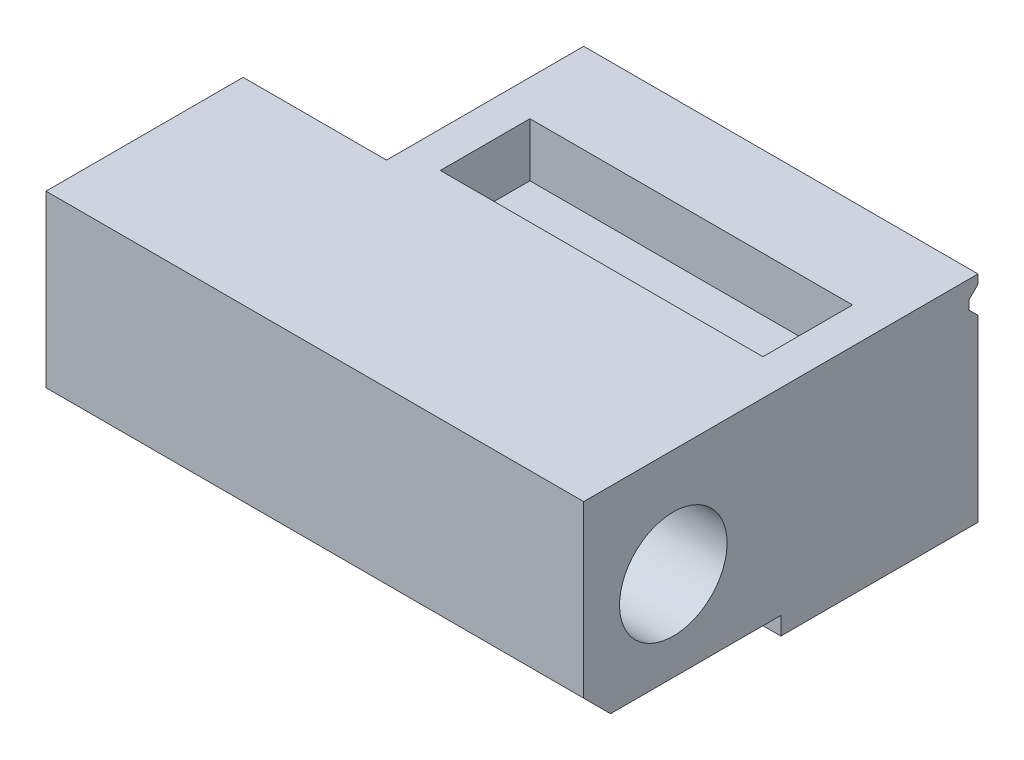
ISO-10303-21;
HEADER;
FILE_DESCRIPTION(('STEP AP214'),'2;1');
FILE_NAME('part.step','',(''),(''),'','','');
FILE_SCHEMA(('AUTOMOTIVE_DESIGN { 1 0 10303 214 1 1 1 1 }'));
ENDSEC;
DATA;
#1=APPLICATION_CONTEXT('core data for automotive mechanical design processes');
#2=APPLICATION_PROTOCOL_DEFINITION('international standard','automotive_design',2000,#1);
#3=PRODUCT_CONTEXT('',#1,'mechanical');
#4=PRODUCT('Part','Part','',(#3));
#5=PRODUCT_RELATED_PRODUCT_CATEGORY('part','',(#4));
#6=PRODUCT_DEFINITION_FORMATION('','',#4);
#7=PRODUCT_DEFINITION_CONTEXT('part definition',#1,'design');
#8=PRODUCT_DEFINITION('design','',#6,#7);
#9=PRODUCT_DEFINITION_SHAPE('','',#8);
#10=(LENGTH_UNIT() NAMED_UNIT(*) SI_UNIT(.MILLI.,.METRE.));
#11=(NAMED_UNIT(*) PLANE_ANGLE_UNIT() SI_UNIT($,.RADIAN.));
#12=(NAMED_UNIT(*) SI_UNIT($,.STERADIAN.) SOLID_ANGLE_UNIT());
#13=UNCERTAINTY_MEASURE_WITH_UNIT(LENGTH_MEASURE(1.E-05),#10,'distance_accuracy_value','');
#14=(GEOMETRIC_REPRESENTATION_CONTEXT(3) GLOBAL_UNCERTAINTY_ASSIGNED_CONTEXT((#13)) GLOBAL_UNIT_ASSIGNED_CONTEXT((#10,
#11,#12)) REPRESENTATION_CONTEXT('',''));
#15=CARTESIAN_POINT('',(0.,0.,0.));
#16=DIRECTION('',(0.,0.,1.));
#17=DIRECTION('',(1.,0.,0.));
#18=AXIS2_PLACEMENT_3D('',#15,#16,#17);
#19=CARTESIAN_POINT('',(-220.,60.,0.));
#20=DIRECTION('',(0.,0.,1.));
#21=DIRECTION('',(1.,0.,0.));
#22=AXIS2_PLACEMENT_3D('',#19,#20,#21);
#23=PLANE('',#22);
#24=DIRECTION('',(1.,0.,0.));
#25=VECTOR('',#24,1.);
#26=CARTESIAN_POINT('',(-220.,-60.,0.));
#27=LINE('',#26,#25);
#28=CARTESIAN_POINT('',(-220.,-60.,0.));
#29=VERTEX_POINT('',#28);
#30=CARTESIAN_POINT('',(0.,-60.,0.));
#31=VERTEX_POINT('',#30);
#32=EDGE_CURVE('E202',#29,#31,#27,.T.);
#33=ORIENTED_EDGE('',*,*,#32,.F.);
#34=DIRECTION('',(0.,-1.,0.));
#35=VECTOR('',#34,1.);
#36=CARTESIAN_POINT('',(-220.,60.,0.));
#37=LINE('',#36,#35);
#38=CARTESIAN_POINT('',(-220.,40.,0.));
#39=VERTEX_POINT('',#38);
#40=EDGE_CURVE('E270',#39,#29,#37,.T.);
#41=ORIENTED_EDGE('',*,*,#40,.F.);
#42=DIRECTION('',(1.,0.,0.));
#43=VECTOR('',#42,1.);
#44=CARTESIAN_POINT('',(-220.,40.,0.));
#45=LINE('',#44,#43);
#46=CARTESIAN_POINT('',(0.,40.,0.));
#47=VERTEX_POINT('',#46);
#48=EDGE_CURVE('E11',#39,#47,#45,.T.);
#49=ORIENTED_EDGE('',*,*,#48,.T.);
#50=DIRECTION('',(0.,1.,0.));
#51=VECTOR('',#50,1.);
#52=CARTESIAN_POINT('',(0.,60.,0.));
#53=LINE('',#52,#51);
#54=EDGE_CURVE('E201',#31,#47,#53,.T.);
#55=ORIENTED_EDGE('',*,*,#54,.F.);
#56=EDGE_LOOP('',(#33,#41,#49,#55));
#57=FACE_BOUND('',#56,.T.);
#58=ADVANCED_FACE('F31',(#57),#23,.F.);
#59=CARTESIAN_POINT('',(-220.,60.,110.));
#60=DIRECTION('',(1.,0.,0.));
#61=DIRECTION('',(0.,1.,0.));
#62=AXIS2_PLACEMENT_3D('',#59,#60,#61);
#63=PLANE('',#62);
#64=DIRECTION('',(0.,-1.,0.));
#65=VECTOR('',#64,1.);
#66=CARTESIAN_POINT('',(-220.,60.,5.));
#67=LINE('',#66,#65);
#68=CARTESIAN_POINT('',(-220.,50.,5.));
#69=VERTEX_POINT('',#68);
#70=CARTESIAN_POINT('',(-220.,45.,5.));
#71=VERTEX_POINT('',#70);
#72=EDGE_CURVE('E290',#69,#71,#67,.T.);
#73=ORIENTED_EDGE('',*,*,#72,.T.);
#74=DIRECTION('',(0.,-0.707106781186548,-0.707106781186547));
#75=VECTOR('',#74,1.);
#76=CARTESIAN_POINT('',(-220.,105.,65.));
#77=LINE('',#76,#75);
#78=EDGE_CURVE('E272',#71,#39,#77,.T.);
#79=ORIENTED_EDGE('',*,*,#78,.T.);
#80=ORIENTED_EDGE('',*,*,#40,.T.);
#81=DIRECTION('',(0.,0.,-1.));
#82=VECTOR('',#81,1.);
#83=CARTESIAN_POINT('',(-220.,-60.,110.));
#84=LINE('',#83,#82);
#85=CARTESIAN_POINT('',(-220.,-60.,110.));
#86=VERTEX_POINT('',#85);
#87=EDGE_CURVE('E250',#86,#29,#84,.T.);
#88=ORIENTED_EDGE('',*,*,#87,.F.);
#89=DIRECTION('',(0.,-1.,0.));
#90=VECTOR('',#89,1.);
#91=CARTESIAN_POINT('',(-220.,60.,110.));
#92=LINE('',#91,#90);
#93=CARTESIAN_POINT('',(-220.,-50.,110.));
#94=VERTEX_POINT('',#93);
#95=EDGE_CURVE('E209',#94,#86,#92,.T.);
#96=ORIENTED_EDGE('',*,*,#95,.F.);
#97=DIRECTION('',(0.,0.,1.));
#98=VECTOR('',#97,1.);
#99=CARTESIAN_POINT('',(-220.,-50.,130.));
#100=LINE('',#99,#98);
#101=CARTESIAN_POINT('',(-220.,-50.,130.));
#102=VERTEX_POINT('',#101);
#103=EDGE_CURVE('E262',#94,#102,#100,.T.);
#104=ORIENTED_EDGE('',*,*,#103,.T.);
#105=DIRECTION('',(0.,0.939793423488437,-0.341743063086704));
#106=VECTOR('',#105,1.);
#107=CARTESIAN_POINT('',(-220.,5.,110.));
#108=LINE('',#107,#106);
#109=CARTESIAN_POINT('',(-220.,5.,110.));
#110=VERTEX_POINT('',#109);
#111=EDGE_CURVE('E361',#102,#110,#108,.T.);
#112=ORIENTED_EDGE('',*,*,#111,.T.);
#113=CARTESIAN_POINT('',(-220.,60.,110.));
#114=VERTEX_POINT('',#113);
#115=EDGE_CURVE('E212',#114,#110,#92,.T.);
#116=ORIENTED_EDGE('',*,*,#115,.F.);
#117=DIRECTION('',(0.,0.,-1.));
#118=VECTOR('',#117,1.);
#119=CARTESIAN_POINT('',(-220.,60.,110.));
#120=LINE('',#119,#118);
#121=CARTESIAN_POINT('',(-220.,60.,0.));
#122=VERTEX_POINT('',#121);
#123=EDGE_CURVE('E236',#114,#122,#120,.T.);
#124=ORIENTED_EDGE('',*,*,#123,.T.);
#125=CARTESIAN_POINT('',(-220.,55.,0.));
#126=VERTEX_POINT('',#125);
#127=EDGE_CURVE('E204',#122,#126,#37,.T.);
#128=ORIENTED_EDGE('',*,*,#127,.T.);
#129=DIRECTION('',(0.,-0.707106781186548,0.707106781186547));
#130=VECTOR('',#129,1.);
#131=CARTESIAN_POINT('',(-220.,2.49999999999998,52.5));
#132=LINE('',#131,#130);
#133=EDGE_CURVE('E46',#126,#69,#132,.T.);
#134=ORIENTED_EDGE('',*,*,#133,.T.);
#135=EDGE_LOOP('',(#73,#79,#80,#88,#96,#104,#112,#116,#124,#128,#134));
#136=FACE_BOUND('',#135,.T.);
#137=ADVANCED_FACE('F33',(#136),#63,.F.);
#138=CARTESIAN_POINT('',(-220.,-60.,110.));
#139=DIRECTION('',(0.,1.,0.));
#140=DIRECTION('',(-1.,0.,0.));
#141=AXIS2_PLACEMENT_3D('',#138,#139,#140);
#142=PLANE('',#141);
#143=DIRECTION('',(1.,0.,0.));
#144=VECTOR('',#143,1.);
#145=CARTESIAN_POINT('',(-200.,-60.,50.));
#146=LINE('',#145,#144);
#147=CARTESIAN_POINT('',(-200.,-60.,50.));
#148=VERTEX_POINT('',#147);
#149=CARTESIAN_POINT('',(-20.,-60.,50.));
#150=VERTEX_POINT('',#149);
#151=EDGE_CURVE('E328',#148,#150,#146,.T.);
#152=ORIENTED_EDGE('',*,*,#151,.F.);
#153=DIRECTION('',(0.,0.,-1.));
#154=VECTOR('',#153,1.);
#155=CARTESIAN_POINT('',(-200.,-60.,100.));
#156=LINE('',#155,#154);
#157=CARTESIAN_POINT('',(-200.,-60.,100.));
#158=VERTEX_POINT('',#157);
#159=EDGE_CURVE('E320',#158,#148,#156,.T.);
#160=ORIENTED_EDGE('',*,*,#159,.F.);
#161=DIRECTION('',(-1.,0.,0.));
#162=VECTOR('',#161,1.);
#163=CARTESIAN_POINT('',(-200.,-60.,100.));
#164=LINE('',#163,#162);
#165=CARTESIAN_POINT('',(-20.,-60.,100.));
#166=VERTEX_POINT('',#165);
#167=EDGE_CURVE('E334',#166,#158,#164,.T.);
#168=ORIENTED_EDGE('',*,*,#167,.F.);
#169=DIRECTION('',(0.,0.,1.));
#170=VECTOR('',#169,1.);
#171=CARTESIAN_POINT('',(-20.,-60.,100.));
#172=LINE('',#171,#170);
#173=EDGE_CURVE('E331',#150,#166,#172,.T.);
#174=ORIENTED_EDGE('',*,*,#173,.F.);
#175=EDGE_LOOP('',(#152,#160,#168,#174));
#176=FACE_BOUND('',#175,.T.);
#177=ORIENTED_EDGE('',*,*,#32,.T.);
#178=DIRECTION('',(0.,0.,-1.));
#179=VECTOR('',#178,1.);
#180=CARTESIAN_POINT('',(0.,-60.,110.));
#181=LINE('',#180,#179);
#182=CARTESIAN_POINT('',(0.,-60.,110.));
#183=VERTEX_POINT('',#182);
#184=EDGE_CURVE('E242',#183,#31,#181,.T.);
#185=ORIENTED_EDGE('',*,*,#184,.F.);
#186=DIRECTION('',(1.,0.,0.));
#187=VECTOR('',#186,1.);
#188=CARTESIAN_POINT('',(-220.,-60.,110.));
#189=LINE('',#188,#187);
#190=EDGE_CURVE('E213',#86,#183,#189,.T.);
#191=ORIENTED_EDGE('',*,*,#190,.F.);
#192=ORIENTED_EDGE('',*,*,#87,.T.);
#193=EDGE_LOOP('',(#177,#185,#191,#192));
#194=FACE_BOUND('',#193,.T.);
#195=ADVANCED_FACE('F274',(#176,#194),#142,.F.);
#196=CARTESIAN_POINT('',(0.,60.,110.));
#197=DIRECTION('',(-1.,0.,0.));
#198=DIRECTION('',(0.,-1.,0.));
#199=AXIS2_PLACEMENT_3D('',#196,#197,#198);
#200=PLANE('',#199);
#201=CARTESIAN_POINT('',(0.,0.,170.));
#202=DIRECTION('',(1.,0.,0.));
#203=DIRECTION('',(0.,1.,0.));
#204=AXIS2_PLACEMENT_3D('',#201,#202,#203);
#205=CIRCLE('',#204,30.);
#206=CARTESIAN_POINT('',(0.,30.,170.));
#207=VERTEX_POINT('',#206);
#208=EDGE_CURVE('E284',#207,#207,#205,.T.);
#209=ORIENTED_EDGE('',*,*,#208,.F.);
#210=EDGE_LOOP('',(#209));
#211=FACE_BOUND('',#210,.T.);
#212=ORIENTED_EDGE('',*,*,#54,.T.);
#213=DIRECTION('',(0.,-0.707106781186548,-0.707106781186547));
#214=VECTOR('',#213,1.);
#215=CARTESIAN_POINT('',(0.,45.,5.));
#216=LINE('',#215,#214);
#217=CARTESIAN_POINT('',(0.,45.,5.));
#218=VERTEX_POINT('',#217);
#219=EDGE_CURVE('E386',#218,#47,#216,.T.);
#220=ORIENTED_EDGE('',*,*,#219,.F.);
#221=DIRECTION('',(0.,-1.,0.));
#222=VECTOR('',#221,1.);
#223=CARTESIAN_POINT('',(0.,50.,5.));
#224=LINE('',#223,#222);
#225=CARTESIAN_POINT('',(0.,50.,5.));
#226=VERTEX_POINT('',#225);
#227=EDGE_CURVE('E196',#226,#218,#224,.T.);
#228=ORIENTED_EDGE('',*,*,#227,.F.);
#229=DIRECTION('',(0.,-0.707106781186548,0.707106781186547));
#230=VECTOR('',#229,1.);
#231=CARTESIAN_POINT('',(0.,55.,0.));
#232=LINE('',#231,#230);
#233=CARTESIAN_POINT('',(0.,55.,0.));
#234=VERTEX_POINT('',#233);
#235=EDGE_CURVE('E182',#234,#226,#232,.T.);
#236=ORIENTED_EDGE('',*,*,#235,.F.);
#237=CARTESIAN_POINT('',(0.,60.,0.));
#238=VERTEX_POINT('',#237);
#239=EDGE_CURVE('E192',#234,#238,#53,.T.);
#240=ORIENTED_EDGE('',*,*,#239,.T.);
#241=DIRECTION('',(0.,0.,-1.));
#242=VECTOR('',#241,1.);
#243=CARTESIAN_POINT('',(0.,60.,110.));
#244=LINE('',#243,#242);
#245=CARTESIAN_POINT('',(0.,60.,220.));
#246=VERTEX_POINT('',#245);
#247=EDGE_CURVE('E238',#246,#238,#244,.T.);
#248=ORIENTED_EDGE('',*,*,#247,.F.);
#249=DIRECTION('',(0.,1.,0.));
#250=VECTOR('',#249,1.);
#251=CARTESIAN_POINT('',(0.,60.,220.));
#252=LINE('',#251,#250);
#253=CARTESIAN_POINT('',(0.,-35.0000000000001,220.));
#254=VERTEX_POINT('',#253);
#255=EDGE_CURVE('E276',#254,#246,#252,.T.);
#256=ORIENTED_EDGE('',*,*,#255,.F.);
#257=DIRECTION('',(0.,-0.707106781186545,-0.70710678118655));
#258=VECTOR('',#257,1.);
#259=CARTESIAN_POINT('',(0.,-35.0000000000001,220.));
#260=LINE('',#259,#258);
#261=CARTESIAN_POINT('',(0.,-50.,205.));
#262=VERTEX_POINT('',#261);
#263=EDGE_CURVE('E224',#254,#262,#260,.T.);
#264=ORIENTED_EDGE('',*,*,#263,.T.);
#265=DIRECTION('',(0.,0.,-1.));
#266=VECTOR('',#265,1.);
#267=CARTESIAN_POINT('',(0.,-50.,220.));
#268=LINE('',#267,#266);
#269=CARTESIAN_POINT('',(0.,-50.,110.));
#270=VERTEX_POINT('',#269);
#271=EDGE_CURVE('E226',#262,#270,#268,.T.);
#272=ORIENTED_EDGE('',*,*,#271,.T.);
#273=DIRECTION('',(0.,1.,0.));
#274=VECTOR('',#273,1.);
#275=CARTESIAN_POINT('',(0.,60.,110.));
#276=LINE('',#275,#274);
#277=EDGE_CURVE('E239',#183,#270,#276,.T.);
#278=ORIENTED_EDGE('',*,*,#277,.F.);
#279=ORIENTED_EDGE('',*,*,#184,.T.);
#280=EDGE_LOOP('',(#212,#220,#228,#236,#240,#248,#256,#264,#272,#278,#279));
#281=FACE_BOUND('',#280,.T.);
#282=ADVANCED_FACE('F190',(#211,#281),#200,.F.);
#283=CARTESIAN_POINT('',(-220.,60.,110.));
#284=DIRECTION('',(0.,-1.,0.));
#285=DIRECTION('',(1.,0.,0.));
#286=AXIS2_PLACEMENT_3D('',#283,#284,#285);
#287=PLANE('',#286);
#288=DIRECTION('',(-1.,0.,0.));
#289=VECTOR('',#288,1.);
#290=CARTESIAN_POINT('',(-20.,60.,50.));
#291=LINE('',#290,#289);
#292=CARTESIAN_POINT('',(-20.,60.,50.));
#293=VERTEX_POINT('',#292);
#294=CARTESIAN_POINT('',(-200.,60.,50.));
#295=VERTEX_POINT('',#294);
#296=EDGE_CURVE('E287',#293,#295,#291,.T.);
#297=ORIENTED_EDGE('',*,*,#296,.F.);
#298=DIRECTION('',(0.,0.,-1.));
#299=VECTOR('',#298,1.);
#300=CARTESIAN_POINT('',(-20.,60.,100.));
#301=LINE('',#300,#299);
#302=CARTESIAN_POINT('',(-20.,60.,100.));
#303=VERTEX_POINT('',#302);
#304=EDGE_CURVE('E283',#303,#293,#301,.T.);
#305=ORIENTED_EDGE('',*,*,#304,.F.);
#306=DIRECTION('',(1.,0.,0.));
#307=VECTOR('',#306,1.);
#308=CARTESIAN_POINT('',(-20.,60.,100.));
#309=LINE('',#308,#307);
#310=CARTESIAN_POINT('',(-200.,60.,100.));
#311=VERTEX_POINT('',#310);
#312=EDGE_CURVE('E302',#311,#303,#309,.T.);
#313=ORIENTED_EDGE('',*,*,#312,.F.);
#314=DIRECTION('',(0.,0.,1.));
#315=VECTOR('',#314,1.);
#316=CARTESIAN_POINT('',(-200.,60.,100.));
#317=LINE('',#316,#315);
#318=EDGE_CURVE('E299',#295,#311,#317,.T.);
#319=ORIENTED_EDGE('',*,*,#318,.F.);
#320=EDGE_LOOP('',(#297,#305,#313,#319));
#321=FACE_BOUND('',#320,.T.);
#322=DIRECTION('',(-1.,0.,0.));
#323=VECTOR('',#322,1.);
#324=CARTESIAN_POINT('',(-220.,60.,0.));
#325=LINE('',#324,#323);
#326=EDGE_CURVE('E200',#238,#122,#325,.T.);
#327=ORIENTED_EDGE('',*,*,#326,.T.);
#328=ORIENTED_EDGE('',*,*,#123,.F.);
#329=DIRECTION('',(-1.,0.,0.));
#330=VECTOR('',#329,1.);
#331=CARTESIAN_POINT('',(-300.,60.,110.));
#332=LINE('',#331,#330);
#333=CARTESIAN_POINT('',(-300.,60.,110.));
#334=VERTEX_POINT('',#333);
#335=EDGE_CURVE('E371',#114,#334,#332,.T.);
#336=ORIENTED_EDGE('',*,*,#335,.T.);
#337=DIRECTION('',(0.,0.,-1.));
#338=VECTOR('',#337,1.);
#339=CARTESIAN_POINT('',(-300.,60.,220.));
#340=LINE('',#339,#338);
#341=CARTESIAN_POINT('',(-300.,60.,220.));
#342=VERTEX_POINT('',#341);
#343=EDGE_CURVE('E230',#342,#334,#340,.T.);
#344=ORIENTED_EDGE('',*,*,#343,.F.);
#345=DIRECTION('',(-1.,0.,0.));
#346=VECTOR('',#345,1.);
#347=CARTESIAN_POINT('',(-300.,60.,220.));
#348=LINE('',#347,#346);
#349=EDGE_CURVE('E489',#246,#342,#348,.T.);
#350=ORIENTED_EDGE('',*,*,#349,.F.);
#351=ORIENTED_EDGE('',*,*,#247,.T.);
#352=EDGE_LOOP('',(#327,#328,#336,#344,#350,#351));
#353=FACE_BOUND('',#352,.T.);
#354=ADVANCED_FACE('F420',(#321,#353),#287,.F.);
#355=CARTESIAN_POINT('',(-220.,60.,110.));
#356=DIRECTION('',(0.,0.,1.));
#357=DIRECTION('',(1.,0.,0.));
#358=AXIS2_PLACEMENT_3D('',#355,#356,#357);
#359=PLANE('',#358);
#360=DIRECTION('',(1.,0.,0.));
#361=VECTOR('',#360,1.);
#362=CARTESIAN_POINT('',(-300.,-50.,110.));
#363=LINE('',#362,#361);
#364=EDGE_CURVE('E225',#94,#270,#363,.T.);
#365=ORIENTED_EDGE('',*,*,#364,.F.);
#366=ORIENTED_EDGE('',*,*,#95,.T.);
#367=ORIENTED_EDGE('',*,*,#190,.T.);
#368=ORIENTED_EDGE('',*,*,#277,.T.);
#369=EDGE_LOOP('',(#365,#366,#367,#368));
#370=FACE_BOUND('',#369,.T.);
#371=ADVANCED_FACE('F264',(#370),#359,.T.);
#372=ORIENTED_EDGE('',*,*,#239,.F.);
#373=DIRECTION('',(-1.,0.,0.));
#374=VECTOR('',#373,1.);
#375=CARTESIAN_POINT('',(-220.,55.,0.));
#376=LINE('',#375,#374);
#377=EDGE_CURVE('E39',#234,#126,#376,.T.);
#378=ORIENTED_EDGE('',*,*,#377,.T.);
#379=ORIENTED_EDGE('',*,*,#127,.F.);
#380=ORIENTED_EDGE('',*,*,#326,.F.);
#381=EDGE_LOOP('',(#372,#378,#379,#380));
#382=FACE_BOUND('',#381,.T.);
#383=ADVANCED_FACE('F199',(#382),#23,.F.);
#384=CARTESIAN_POINT('',(-300.,-50.,110.));
#385=DIRECTION('',(0.,0.,1.));
#386=DIRECTION('',(1.,0.,0.));
#387=AXIS2_PLACEMENT_3D('',#384,#385,#386);
#388=PLANE('',#387);
#389=ORIENTED_EDGE('',*,*,#115,.T.);
#390=DIRECTION('',(-1.,0.,0.));
#391=VECTOR('',#390,1.);
#392=CARTESIAN_POINT('',(-220.,5.,110.));
#393=LINE('',#392,#391);
#394=CARTESIAN_POINT('',(-300.,5.,110.));
#395=VERTEX_POINT('',#394);
#396=EDGE_CURVE('E364',#110,#395,#393,.T.);
#397=ORIENTED_EDGE('',*,*,#396,.T.);
#398=DIRECTION('',(0.,-1.,0.));
#399=VECTOR('',#398,1.);
#400=CARTESIAN_POINT('',(-300.,60.,110.));
#401=LINE('',#400,#399);
#402=EDGE_CURVE('E367',#334,#395,#401,.T.);
#403=ORIENTED_EDGE('',*,*,#402,.F.);
#404=ORIENTED_EDGE('',*,*,#335,.F.);
#405=EDGE_LOOP('',(#389,#397,#403,#404));
#406=FACE_BOUND('',#405,.T.);
#407=ADVANCED_FACE('F412',(#406),#388,.F.);
#408=CARTESIAN_POINT('',(-300.,60.,220.));
#409=DIRECTION('',(1.,0.,0.));
#410=DIRECTION('',(0.,0.,-1.));
#411=AXIS2_PLACEMENT_3D('',#408,#409,#410);
#412=PLANE('',#411);
#413=CARTESIAN_POINT('',(-300.,0.,170.));
#414=DIRECTION('',(1.,0.,0.));
#415=DIRECTION('',(0.,0.,-1.));
#416=AXIS2_PLACEMENT_3D('',#413,#414,#415);
#417=CIRCLE('',#416,30.);
#418=CARTESIAN_POINT('',(-300.,29.9999999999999,170.));
#419=VERTEX_POINT('',#418);
#420=EDGE_CURVE('E281',#419,#419,#417,.T.);
#421=ORIENTED_EDGE('',*,*,#420,.T.);
#422=EDGE_LOOP('',(#421));
#423=FACE_BOUND('',#422,.T.);
#424=DIRECTION('',(0.,0.,-1.));
#425=VECTOR('',#424,1.);
#426=CARTESIAN_POINT('',(-300.,-50.,220.));
#427=LINE('',#426,#425);
#428=CARTESIAN_POINT('',(-300.,-50.,205.));
#429=VERTEX_POINT('',#428);
#430=CARTESIAN_POINT('',(-300.,-50.,130.));
#431=VERTEX_POINT('',#430);
#432=EDGE_CURVE('E229',#429,#431,#427,.T.);
#433=ORIENTED_EDGE('',*,*,#432,.F.);
#434=DIRECTION('',(0.,0.707106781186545,0.70710678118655));
#435=VECTOR('',#434,1.);
#436=CARTESIAN_POINT('',(-300.,-35.0000000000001,220.));
#437=LINE('',#436,#435);
#438=CARTESIAN_POINT('',(-300.,-35.0000000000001,220.));
#439=VERTEX_POINT('',#438);
#440=EDGE_CURVE('E188',#429,#439,#437,.T.);
#441=ORIENTED_EDGE('',*,*,#440,.T.);
#442=DIRECTION('',(0.,-1.,0.));
#443=VECTOR('',#442,1.);
#444=CARTESIAN_POINT('',(-300.,60.,220.));
#445=LINE('',#444,#443);
#446=EDGE_CURVE('E376',#342,#439,#445,.T.);
#447=ORIENTED_EDGE('',*,*,#446,.F.);
#448=ORIENTED_EDGE('',*,*,#343,.T.);
#449=ORIENTED_EDGE('',*,*,#402,.T.);
#450=DIRECTION('',(0.,0.939793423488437,-0.341743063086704));
#451=VECTOR('',#450,1.);
#452=CARTESIAN_POINT('',(-300.,5.,110.));
#453=LINE('',#452,#451);
#454=EDGE_CURVE('E352',#431,#395,#453,.T.);
#455=ORIENTED_EDGE('',*,*,#454,.F.);
#456=EDGE_LOOP('',(#433,#441,#447,#448,#449,#455));
#457=FACE_BOUND('',#456,.T.);
#458=ADVANCED_FACE('F417',(#423,#457),#412,.F.);
#459=CARTESIAN_POINT('',(-300.,-50.,220.));
#460=DIRECTION('',(0.,1.,0.));
#461=DIRECTION('',(0.,0.,1.));
#462=AXIS2_PLACEMENT_3D('',#459,#460,#461);
#463=PLANE('',#462);
#464=ORIENTED_EDGE('',*,*,#271,.F.);
#465=DIRECTION('',(-1.,0.,0.));
#466=VECTOR('',#465,1.);
#467=CARTESIAN_POINT('',(-300.,-50.,205.));
#468=LINE('',#467,#466);
#469=EDGE_CURVE('E54',#262,#429,#468,.T.);
#470=ORIENTED_EDGE('',*,*,#469,.T.);
#471=ORIENTED_EDGE('',*,*,#432,.T.);
#472=DIRECTION('',(-1.,0.,0.));
#473=VECTOR('',#472,1.);
#474=CARTESIAN_POINT('',(-220.,-50.,130.));
#475=LINE('',#474,#473);
#476=EDGE_CURVE('E363',#102,#431,#475,.T.);
#477=ORIENTED_EDGE('',*,*,#476,.F.);
#478=ORIENTED_EDGE('',*,*,#103,.F.);
#479=ORIENTED_EDGE('',*,*,#364,.T.);
#480=EDGE_LOOP('',(#464,#470,#471,#477,#478,#479));
#481=FACE_BOUND('',#480,.T.);
#482=ADVANCED_FACE('F260',(#481),#463,.F.);
#483=CARTESIAN_POINT('',(-300.,-50.,220.));
#484=DIRECTION('',(0.,0.,1.));
#485=DIRECTION('',(1.,0.,0.));
#486=AXIS2_PLACEMENT_3D('',#483,#484,#485);
#487=PLANE('',#486);
#488=ORIENTED_EDGE('',*,*,#446,.T.);
#489=DIRECTION('',(1.,0.,0.));
#490=VECTOR('',#489,1.);
#491=CARTESIAN_POINT('',(0.,-35.0000000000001,220.));
#492=LINE('',#491,#490);
#493=EDGE_CURVE('E221',#439,#254,#492,.T.);
#494=ORIENTED_EDGE('',*,*,#493,.T.);
#495=ORIENTED_EDGE('',*,*,#255,.T.);
#496=ORIENTED_EDGE('',*,*,#349,.T.);
#497=EDGE_LOOP('',(#488,#494,#495,#496));
#498=FACE_BOUND('',#497,.T.);
#499=ADVANCED_FACE('F472',(#498),#487,.T.);
#500=CARTESIAN_POINT('',(-220.,5.,110.));
#501=DIRECTION('',(0.,0.341743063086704,0.939793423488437));
#502=DIRECTION('',(0.,-0.939793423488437,0.341743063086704));
#503=AXIS2_PLACEMENT_3D('',#500,#501,#502);
#504=PLANE('',#503);
#505=ORIENTED_EDGE('',*,*,#454,.T.);
#506=ORIENTED_EDGE('',*,*,#396,.F.);
#507=ORIENTED_EDGE('',*,*,#111,.F.);
#508=ORIENTED_EDGE('',*,*,#476,.T.);
#509=EDGE_LOOP('',(#505,#506,#507,#508));
#510=FACE_BOUND('',#509,.T.);
#511=ADVANCED_FACE('F470',(#510),#504,.F.);
#512=CARTESIAN_POINT('',(-200.,-30.,100.));
#513=DIRECTION('',(-1.,0.,0.));
#514=DIRECTION('',(0.,-1.,0.));
#515=AXIS2_PLACEMENT_3D('',#512,#513,#514);
#516=PLANE('',#515);
#517=ORIENTED_EDGE('',*,*,#159,.T.);
#518=DIRECTION('',(0.,-1.,0.));
#519=VECTOR('',#518,1.);
#520=CARTESIAN_POINT('',(-200.,-30.,50.));
#521=LINE('',#520,#519);
#522=CARTESIAN_POINT('',(-200.,-30.,50.));
#523=VERTEX_POINT('',#522);
#524=EDGE_CURVE('E349',#523,#148,#521,.T.);
#525=ORIENTED_EDGE('',*,*,#524,.F.);
#526=DIRECTION('',(0.,0.,-1.));
#527=VECTOR('',#526,1.);
#528=CARTESIAN_POINT('',(-200.,-30.,100.));
#529=LINE('',#528,#527);
#530=CARTESIAN_POINT('',(-200.,-30.,100.));
#531=VERTEX_POINT('',#530);
#532=EDGE_CURVE('E337',#531,#523,#529,.T.);
#533=ORIENTED_EDGE('',*,*,#532,.F.);
#534=DIRECTION('',(0.,-1.,0.));
#535=VECTOR('',#534,1.);
#536=CARTESIAN_POINT('',(-200.,-30.,100.));
#537=LINE('',#536,#535);
#538=EDGE_CURVE('E350',#531,#158,#537,.T.);
#539=ORIENTED_EDGE('',*,*,#538,.T.);
#540=EDGE_LOOP('',(#517,#525,#533,#539));
#541=FACE_BOUND('',#540,.T.);
#542=ADVANCED_FACE('F443',(#541),#516,.F.);
#543=CARTESIAN_POINT('',(-200.,-30.,100.));
#544=DIRECTION('',(0.,0.,1.));
#545=DIRECTION('',(1.,0.,0.));
#546=AXIS2_PLACEMENT_3D('',#543,#544,#545);
#547=PLANE('',#546);
#548=ORIENTED_EDGE('',*,*,#167,.T.);
#549=ORIENTED_EDGE('',*,*,#538,.F.);
#550=DIRECTION('',(-1.,0.,0.));
#551=VECTOR('',#550,1.);
#552=CARTESIAN_POINT('',(-200.,-30.,100.));
#553=LINE('',#552,#551);
#554=CARTESIAN_POINT('',(-20.,-30.,100.));
#555=VERTEX_POINT('',#554);
#556=EDGE_CURVE('E346',#555,#531,#553,.T.);
#557=ORIENTED_EDGE('',*,*,#556,.F.);
#558=DIRECTION('',(0.,-1.,0.));
#559=VECTOR('',#558,1.);
#560=CARTESIAN_POINT('',(-20.,-30.,100.));
#561=LINE('',#560,#559);
#562=EDGE_CURVE('E353',#555,#166,#561,.T.);
#563=ORIENTED_EDGE('',*,*,#562,.T.);
#564=EDGE_LOOP('',(#548,#549,#557,#563));
#565=FACE_BOUND('',#564,.T.);
#566=ADVANCED_FACE('F446',(#565),#547,.F.);
#567=CARTESIAN_POINT('',(-20.,-30.,100.));
#568=DIRECTION('',(1.,0.,0.));
#569=DIRECTION('',(0.,0.,-1.));
#570=AXIS2_PLACEMENT_3D('',#567,#568,#569);
#571=PLANE('',#570);
#572=ORIENTED_EDGE('',*,*,#173,.T.);
#573=ORIENTED_EDGE('',*,*,#562,.F.);
#574=DIRECTION('',(0.,0.,1.));
#575=VECTOR('',#574,1.);
#576=CARTESIAN_POINT('',(-20.,-30.,100.));
#577=LINE('',#576,#575);
#578=CARTESIAN_POINT('',(-20.,-30.,50.));
#579=VERTEX_POINT('',#578);
#580=EDGE_CURVE('E343',#579,#555,#577,.T.);
#581=ORIENTED_EDGE('',*,*,#580,.F.);
#582=DIRECTION('',(0.,-1.,0.));
#583=VECTOR('',#582,1.);
#584=CARTESIAN_POINT('',(-20.,-30.,50.));
#585=LINE('',#584,#583);
#586=EDGE_CURVE('E355',#579,#150,#585,.T.);
#587=ORIENTED_EDGE('',*,*,#586,.T.);
#588=EDGE_LOOP('',(#572,#573,#581,#587));
#589=FACE_BOUND('',#588,.T.);
#590=ADVANCED_FACE('F448',(#589),#571,.F.);
#591=CARTESIAN_POINT('',(-200.,-30.,50.));
#592=DIRECTION('',(0.,0.,-1.));
#593=DIRECTION('',(-1.,0.,0.));
#594=AXIS2_PLACEMENT_3D('',#591,#592,#593);
#595=PLANE('',#594);
#596=ORIENTED_EDGE('',*,*,#151,.T.);
#597=ORIENTED_EDGE('',*,*,#586,.F.);
#598=DIRECTION('',(1.,0.,0.));
#599=VECTOR('',#598,1.);
#600=CARTESIAN_POINT('',(-200.,-30.,50.));
#601=LINE('',#600,#599);
#602=EDGE_CURVE('E340',#523,#579,#601,.T.);
#603=ORIENTED_EDGE('',*,*,#602,.F.);
#604=ORIENTED_EDGE('',*,*,#524,.T.);
#605=EDGE_LOOP('',(#596,#597,#603,#604));
#606=FACE_BOUND('',#605,.T.);
#607=ADVANCED_FACE('F438',(#606),#595,.F.);
#608=CARTESIAN_POINT('',(-200.,-30.,50.));
#609=DIRECTION('',(0.,-1.,0.));
#610=DIRECTION('',(1.,0.,0.));
#611=AXIS2_PLACEMENT_3D('',#608,#609,#610);
#612=PLANE('',#611);
#613=ORIENTED_EDGE('',*,*,#532,.T.);
#614=ORIENTED_EDGE('',*,*,#602,.T.);
#615=ORIENTED_EDGE('',*,*,#580,.T.);
#616=ORIENTED_EDGE('',*,*,#556,.T.);
#617=EDGE_LOOP('',(#613,#614,#615,#616));
#618=FACE_BOUND('',#617,.T.);
#619=ADVANCED_FACE('F450',(#618),#612,.T.);
#620=CARTESIAN_POINT('',(-20.,30.,100.));
#621=DIRECTION('',(1.,0.,0.));
#622=DIRECTION('',(0.,0.,-1.));
#623=AXIS2_PLACEMENT_3D('',#620,#621,#622);
#624=PLANE('',#623);
#625=ORIENTED_EDGE('',*,*,#304,.T.);
#626=DIRECTION('',(0.,1.,0.));
#627=VECTOR('',#626,1.);
#628=CARTESIAN_POINT('',(-20.,30.,50.));
#629=LINE('',#628,#627);
#630=CARTESIAN_POINT('',(-20.,30.,50.));
#631=VERTEX_POINT('',#630);
#632=EDGE_CURVE('E317',#631,#293,#629,.T.);
#633=ORIENTED_EDGE('',*,*,#632,.F.);
#634=DIRECTION('',(0.,0.,-1.));
#635=VECTOR('',#634,1.);
#636=CARTESIAN_POINT('',(-20.,30.,100.));
#637=LINE('',#636,#635);
#638=CARTESIAN_POINT('',(-20.,30.,100.));
#639=VERTEX_POINT('',#638);
#640=EDGE_CURVE('E305',#639,#631,#637,.T.);
#641=ORIENTED_EDGE('',*,*,#640,.F.);
#642=DIRECTION('',(0.,1.,0.));
#643=VECTOR('',#642,1.);
#644=CARTESIAN_POINT('',(-20.,30.,100.));
#645=LINE('',#644,#643);
#646=EDGE_CURVE('E318',#639,#303,#645,.T.);
#647=ORIENTED_EDGE('',*,*,#646,.T.);
#648=EDGE_LOOP('',(#625,#633,#641,#647));
#649=FACE_BOUND('',#648,.T.);
#650=ADVANCED_FACE('F452',(#649),#624,.F.);
#651=CARTESIAN_POINT('',(-20.,30.,100.));
#652=DIRECTION('',(0.,0.,1.));
#653=DIRECTION('',(1.,0.,0.));
#654=AXIS2_PLACEMENT_3D('',#651,#652,#653);
#655=PLANE('',#654);
#656=ORIENTED_EDGE('',*,*,#312,.T.);
#657=ORIENTED_EDGE('',*,*,#646,.F.);
#658=DIRECTION('',(1.,0.,0.));
#659=VECTOR('',#658,1.);
#660=CARTESIAN_POINT('',(-20.,30.,100.));
#661=LINE('',#660,#659);
#662=CARTESIAN_POINT('',(-200.,30.,100.));
#663=VERTEX_POINT('',#662);
#664=EDGE_CURVE('E314',#663,#639,#661,.T.);
#665=ORIENTED_EDGE('',*,*,#664,.F.);
#666=DIRECTION('',(0.,1.,0.));
#667=VECTOR('',#666,1.);
#668=CARTESIAN_POINT('',(-200.,30.,100.));
#669=LINE('',#668,#667);
#670=EDGE_CURVE('E321',#663,#311,#669,.T.);
#671=ORIENTED_EDGE('',*,*,#670,.T.);
#672=EDGE_LOOP('',(#656,#657,#665,#671));
#673=FACE_BOUND('',#672,.T.);
#674=ADVANCED_FACE('F458',(#673),#655,.F.);
#675=CARTESIAN_POINT('',(-200.,30.,100.));
#676=DIRECTION('',(-1.,0.,0.));
#677=DIRECTION('',(0.,0.,1.));
#678=AXIS2_PLACEMENT_3D('',#675,#676,#677);
#679=PLANE('',#678);
#680=ORIENTED_EDGE('',*,*,#318,.T.);
#681=ORIENTED_EDGE('',*,*,#670,.F.);
#682=DIRECTION('',(0.,0.,1.));
#683=VECTOR('',#682,1.);
#684=CARTESIAN_POINT('',(-200.,30.,100.));
#685=LINE('',#684,#683);
#686=CARTESIAN_POINT('',(-200.,30.,50.));
#687=VERTEX_POINT('',#686);
#688=EDGE_CURVE('E311',#687,#663,#685,.T.);
#689=ORIENTED_EDGE('',*,*,#688,.F.);
#690=DIRECTION('',(0.,1.,0.));
#691=VECTOR('',#690,1.);
#692=CARTESIAN_POINT('',(-200.,30.,50.));
#693=LINE('',#692,#691);
#694=EDGE_CURVE('E323',#687,#295,#693,.T.);
#695=ORIENTED_EDGE('',*,*,#694,.T.);
#696=EDGE_LOOP('',(#680,#681,#689,#695));
#697=FACE_BOUND('',#696,.T.);
#698=ADVANCED_FACE('F510',(#697),#679,.F.);
#699=CARTESIAN_POINT('',(-20.,30.,50.));
#700=DIRECTION('',(0.,0.,-1.));
#701=DIRECTION('',(-1.,0.,0.));
#702=AXIS2_PLACEMENT_3D('',#699,#700,#701);
#703=PLANE('',#702);
#704=ORIENTED_EDGE('',*,*,#296,.T.);
#705=ORIENTED_EDGE('',*,*,#694,.F.);
#706=DIRECTION('',(-1.,0.,0.));
#707=VECTOR('',#706,1.);
#708=CARTESIAN_POINT('',(-20.,30.,50.));
#709=LINE('',#708,#707);
#710=EDGE_CURVE('E308',#631,#687,#709,.T.);
#711=ORIENTED_EDGE('',*,*,#710,.F.);
#712=ORIENTED_EDGE('',*,*,#632,.T.);
#713=EDGE_LOOP('',(#704,#705,#711,#712));
#714=FACE_BOUND('',#713,.T.);
#715=ADVANCED_FACE('F504',(#714),#703,.F.);
#716=CARTESIAN_POINT('',(-20.,30.,50.));
#717=DIRECTION('',(0.,1.,0.));
#718=DIRECTION('',(-1.,0.,0.));
#719=AXIS2_PLACEMENT_3D('',#716,#717,#718);
#720=PLANE('',#719);
#721=ORIENTED_EDGE('',*,*,#640,.T.);
#722=ORIENTED_EDGE('',*,*,#710,.T.);
#723=ORIENTED_EDGE('',*,*,#688,.T.);
#724=ORIENTED_EDGE('',*,*,#664,.T.);
#725=EDGE_LOOP('',(#721,#722,#723,#724));
#726=FACE_BOUND('',#725,.T.);
#727=ADVANCED_FACE('F497',(#726),#720,.T.);
#728=CARTESIAN_POINT('',(-300.,-35.0000000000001,220.));
#729=DIRECTION('',(0.,-0.70710678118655,0.707106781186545));
#730=DIRECTION('',(0.,-0.707106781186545,-0.70710678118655));
#731=AXIS2_PLACEMENT_3D('',#728,#729,#730);
#732=PLANE('',#731);
#733=ORIENTED_EDGE('',*,*,#440,.F.);
#734=ORIENTED_EDGE('',*,*,#469,.F.);
#735=ORIENTED_EDGE('',*,*,#263,.F.);
#736=ORIENTED_EDGE('',*,*,#493,.F.);
#737=EDGE_LOOP('',(#733,#734,#735,#736));
#738=FACE_BOUND('',#737,.T.);
#739=ADVANCED_FACE('F487',(#738),#732,.T.);
#740=CARTESIAN_POINT('',(-300.000025,0.,170.));
#741=DIRECTION('',(1.,0.,0.));
#742=DIRECTION('',(0.,1.,0.));
#743=AXIS2_PLACEMENT_3D('',#740,#741,#742);
#744=CYLINDRICAL_SURFACE('',#743,30.);
#745=CARTESIAN_POINT('',(0.,30.,170.));
#746=CARTESIAN_POINT('',(-3.12500000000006,30.,170.));
#747=CARTESIAN_POINT('',(-6.25000000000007,30.,170.));
#748=CARTESIAN_POINT('',(-12.5000000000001,30.,170.));
#749=CARTESIAN_POINT('',(-15.6250000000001,30.,170.));
#750=CARTESIAN_POINT('',(-21.875,30.,170.));
#751=CARTESIAN_POINT('',(-25.0000000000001,30.,170.));
#752=CARTESIAN_POINT('',(-31.2500000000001,30.,170.));
#753=CARTESIAN_POINT('',(-34.375,30.,170.));
#754=CARTESIAN_POINT('',(-40.625,30.,170.));
#755=CARTESIAN_POINT('',(-43.75,30.,170.));
#756=CARTESIAN_POINT('',(-50.,30.,170.));
#757=CARTESIAN_POINT('',(-53.125,30.,170.));
#758=CARTESIAN_POINT('',(-59.375,30.,170.));
#759=CARTESIAN_POINT('',(-62.5,30.,170.));
#760=CARTESIAN_POINT('',(-68.75,30.,170.));
#761=CARTESIAN_POINT('',(-71.875,30.,170.));
#762=CARTESIAN_POINT('',(-78.125,30.,170.));
#763=CARTESIAN_POINT('',(-81.25,30.,170.));
#764=CARTESIAN_POINT('',(-87.5,30.,170.));
#765=CARTESIAN_POINT('',(-90.625,30.,170.));
#766=CARTESIAN_POINT('',(-96.875,30.,170.));
#767=CARTESIAN_POINT('',(-100.,29.9999999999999,170.));
#768=CARTESIAN_POINT('',(-106.25,29.9999999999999,170.));
#769=CARTESIAN_POINT('',(-109.375,29.9999999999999,170.));
#770=CARTESIAN_POINT('',(-115.625,29.9999999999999,170.));
#771=CARTESIAN_POINT('',(-118.75,29.9999999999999,170.));
#772=CARTESIAN_POINT('',(-125.,29.9999999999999,170.));
#773=CARTESIAN_POINT('',(-128.125,29.9999999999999,170.));
#774=CARTESIAN_POINT('',(-134.375,29.9999999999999,170.));
#775=CARTESIAN_POINT('',(-137.5,29.9999999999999,170.));
#776=CARTESIAN_POINT('',(-143.75,29.9999999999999,170.));
#777=CARTESIAN_POINT('',(-146.875,29.9999999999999,170.));
#778=CARTESIAN_POINT('',(-153.125,29.9999999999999,170.));
#779=CARTESIAN_POINT('',(-156.25,29.9999999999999,170.));
#780=CARTESIAN_POINT('',(-162.5,29.9999999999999,170.));
#781=CARTESIAN_POINT('',(-165.625,29.9999999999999,170.));
#782=CARTESIAN_POINT('',(-171.875,29.9999999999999,170.));
#783=CARTESIAN_POINT('',(-175.,29.9999999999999,170.));
#784=CARTESIAN_POINT('',(-181.25,29.9999999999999,170.));
#785=CARTESIAN_POINT('',(-184.375,29.9999999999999,170.));
#786=CARTESIAN_POINT('',(-190.625,29.9999999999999,170.));
#787=CARTESIAN_POINT('',(-193.75,29.9999999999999,170.));
#788=CARTESIAN_POINT('',(-200.,29.9999999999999,170.));
#789=CARTESIAN_POINT('',(-203.125,29.9999999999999,170.));
#790=CARTESIAN_POINT('',(-209.375,29.9999999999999,170.));
#791=CARTESIAN_POINT('',(-212.5,29.9999999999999,170.));
#792=CARTESIAN_POINT('',(-218.75,29.9999999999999,170.));
#793=CARTESIAN_POINT('',(-221.875,29.9999999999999,170.));
#794=CARTESIAN_POINT('',(-228.125,29.9999999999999,170.));
#795=CARTESIAN_POINT('',(-231.25,29.9999999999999,170.));
#796=CARTESIAN_POINT('',(-237.5,29.9999999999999,170.));
#797=CARTESIAN_POINT('',(-240.625,29.9999999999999,170.));
#798=CARTESIAN_POINT('',(-246.875,29.9999999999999,170.));
#799=CARTESIAN_POINT('',(-250.,29.9999999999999,170.));
#800=CARTESIAN_POINT('',(-256.25,29.9999999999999,170.));
#801=CARTESIAN_POINT('',(-259.375,29.9999999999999,170.));
#802=CARTESIAN_POINT('',(-265.625,29.9999999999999,170.));
#803=CARTESIAN_POINT('',(-268.75,29.9999999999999,170.));
#804=CARTESIAN_POINT('',(-275.,29.9999999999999,170.));
#805=CARTESIAN_POINT('',(-278.125,29.9999999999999,170.));
#806=CARTESIAN_POINT('',(-284.375,29.9999999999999,170.));
#807=CARTESIAN_POINT('',(-287.5,29.9999999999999,170.));
#808=CARTESIAN_POINT('',(-293.75,29.9999999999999,170.));
#809=CARTESIAN_POINT('',(-296.875,29.9999999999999,170.));
#810=CARTESIAN_POINT('',(-300.,29.9999999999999,170.));
#811=B_SPLINE_CURVE_WITH_KNOTS('',3,(#745,#746,#747,#748,#749,#750,#751,#752,#753,#754,#755,
#756,#757,#758,#759,#760,#761,#762,#763,#764,#765,#766,#767,#768,#769,#770,#771,#772,#773,#774,
#775,#776,#777,#778,#779,#780,#781,#782,#783,#784,#785,#786,#787,#788,#789,#790,#791,#792,#793,
#794,#795,#796,#797,#798,#799,#800,#801,#802,#803,#804,#805,#806,#807,#808,#809,#810),
.UNSPECIFIED.,.F.,.F.,(4,2,2,2,2,2,2,2,2,2,2,2,2,2,2,2,2,2,2,2,2,2,2,2,2,2,2,2,2,2,2,2,4),(0.,
9.37500000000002,18.75,28.125,37.5,46.875,56.25,65.625,75.,84.3749999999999,93.75,103.125,112.5,
121.875,131.25,140.625,150.,159.375,168.75,178.125,187.5,196.875,206.25,215.625,225.,234.375,
243.75,253.125,262.5,271.875,281.25,290.625,300.),.UNSPECIFIED.);
#812=EDGE_CURVE('BSEAM402',#207,#419,#811,.T.);
#813=ORIENTED_EDGE('',*,*,#208,.T.);
#814=ORIENTED_EDGE('',*,*,#420,.F.);
#815=ORIENTED_EDGE('',*,*,#812,.T.);
#816=ORIENTED_EDGE('',*,*,#812,.F.);
#817=EDGE_LOOP('',(#813,#815,#814,#816));
#818=FACE_BOUND('',#817,.T.);
#819=ADVANCED_FACE('F402',(#818),#744,.F.);
#820=CARTESIAN_POINT('',(-300.000025,49.9999999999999,5.));
#821=DIRECTION('',(0.,0.,1.));
#822=DIRECTION('',(1.,0.,0.));
#823=AXIS2_PLACEMENT_3D('',#820,#821,#822);
#824=PLANE('',#823);
#825=DIRECTION('',(1.,0.,0.));
#826=VECTOR('',#825,1.);
#827=CARTESIAN_POINT('',(-300.000025,49.9999999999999,5.));
#828=LINE('',#827,#826);
#829=EDGE_CURVE('E383',#69,#226,#828,.T.);
#830=ORIENTED_EDGE('',*,*,#829,.T.);
#831=ORIENTED_EDGE('',*,*,#227,.T.);
#832=DIRECTION('',(1.,0.,0.));
#833=VECTOR('',#832,1.);
#834=CARTESIAN_POINT('',(-300.000025,44.9999999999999,5.));
#835=LINE('',#834,#833);
#836=EDGE_CURVE('E381',#71,#218,#835,.T.);
#837=ORIENTED_EDGE('',*,*,#836,.F.);
#838=ORIENTED_EDGE('',*,*,#72,.F.);
#839=EDGE_LOOP('',(#830,#831,#837,#838));
#840=FACE_BOUND('',#839,.T.);
#841=ADVANCED_FACE('F392',(#840),#824,.F.);
#842=CARTESIAN_POINT('',(-300.000025,44.9999999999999,5.));
#843=DIRECTION('',(0.,-0.707106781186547,0.707106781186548));
#844=DIRECTION('',(0.,-0.707106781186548,-0.707106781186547));
#845=AXIS2_PLACEMENT_3D('',#842,#843,#844);
#846=PLANE('',#845);
#847=ORIENTED_EDGE('',*,*,#836,.T.);
#848=ORIENTED_EDGE('',*,*,#219,.T.);
#849=ORIENTED_EDGE('',*,*,#48,.F.);
#850=ORIENTED_EDGE('',*,*,#78,.F.);
#851=EDGE_LOOP('',(#847,#848,#849,#850));
#852=FACE_BOUND('',#851,.T.);
#853=ADVANCED_FACE('F394',(#852),#846,.F.);
#854=CARTESIAN_POINT('',(-300.000025,54.9999999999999,0.));
#855=DIRECTION('',(0.,0.707106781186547,0.707106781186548));
#856=DIRECTION('',(0.,-0.707106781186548,0.707106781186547));
#857=AXIS2_PLACEMENT_3D('',#854,#855,#856);
#858=PLANE('',#857);
#859=ORIENTED_EDGE('',*,*,#377,.F.);
#860=ORIENTED_EDGE('',*,*,#235,.T.);
#861=ORIENTED_EDGE('',*,*,#829,.F.);
#862=ORIENTED_EDGE('',*,*,#133,.F.);
#863=EDGE_LOOP('',(#859,#860,#861,#862));
#864=FACE_BOUND('',#863,.T.);
#865=ADVANCED_FACE('F181',(#864),#858,.F.);
#866=CLOSED_SHELL('',(#58,#137,#195,#282,#354,#371,#383,#407,#458,#482,#499,#511,#542,#566,#590,
#607,#619,#650,#674,#698,#715,#727,#739,#819,#841,#853,#865));
#867=MANIFOLD_SOLID_BREP('B2',#866);
#868=ADVANCED_BREP_SHAPE_REPRESENTATION('',(#18,#867),#14);
#869=SHAPE_DEFINITION_REPRESENTATION(#9,#868);
ENDSEC;
END-ISO-10303-21;
